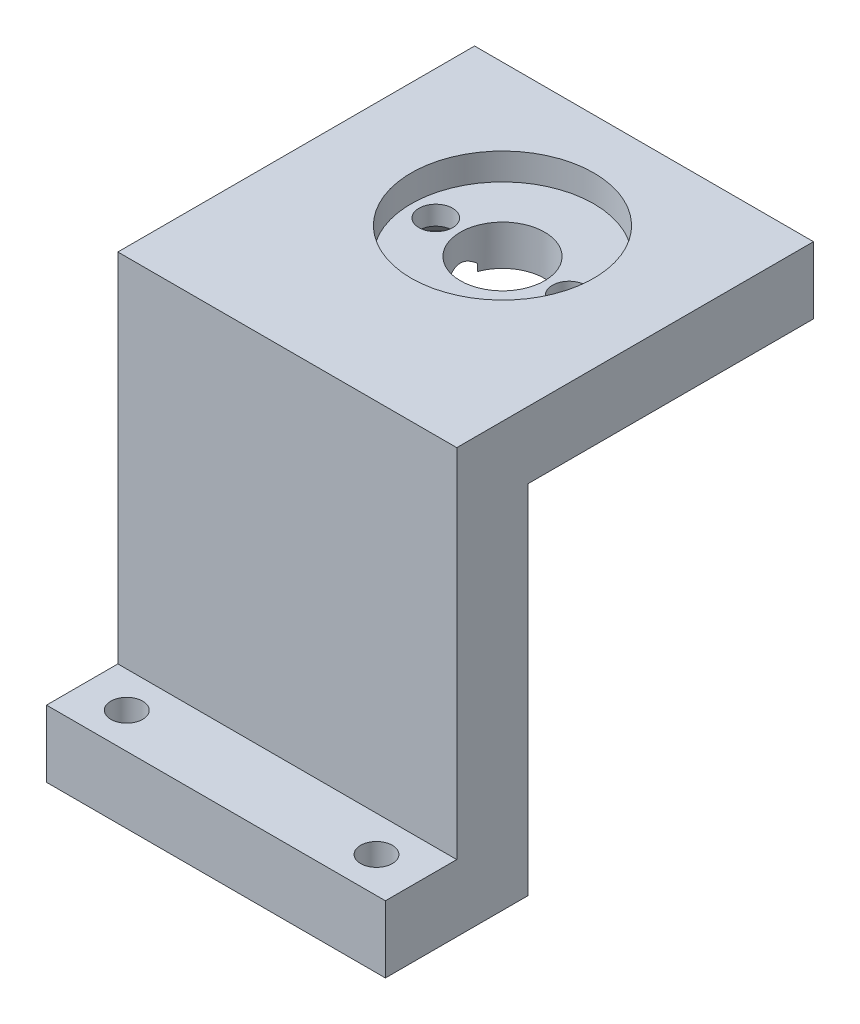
ISO-10303-21;
HEADER;
FILE_DESCRIPTION(('STEP AP214'),'2;1');
FILE_NAME('part.step','',(''),(''),'','','');
FILE_SCHEMA(('AUTOMOTIVE_DESIGN { 1 0 10303 214 1 1 1 1 }'));
ENDSEC;
DATA;
#1=APPLICATION_CONTEXT('core data for automotive mechanical design processes');
#2=APPLICATION_PROTOCOL_DEFINITION('international standard','automotive_design',2000,#1);
#3=PRODUCT_CONTEXT('',#1,'mechanical');
#4=PRODUCT('Part','Part','',(#3));
#5=PRODUCT_RELATED_PRODUCT_CATEGORY('part','',(#4));
#6=PRODUCT_DEFINITION_FORMATION('','',#4);
#7=PRODUCT_DEFINITION_CONTEXT('part definition',#1,'design');
#8=PRODUCT_DEFINITION('design','',#6,#7);
#9=PRODUCT_DEFINITION_SHAPE('','',#8);
#10=(LENGTH_UNIT() NAMED_UNIT(*) SI_UNIT(.MILLI.,.METRE.));
#11=(NAMED_UNIT(*) PLANE_ANGLE_UNIT() SI_UNIT($,.RADIAN.));
#12=(NAMED_UNIT(*) SI_UNIT($,.STERADIAN.) SOLID_ANGLE_UNIT());
#13=UNCERTAINTY_MEASURE_WITH_UNIT(LENGTH_MEASURE(1.E-05),#10,'distance_accuracy_value','');
#14=(GEOMETRIC_REPRESENTATION_CONTEXT(3) GLOBAL_UNCERTAINTY_ASSIGNED_CONTEXT((#13)) GLOBAL_UNIT_ASSIGNED_CONTEXT((#10,
#11,#12)) REPRESENTATION_CONTEXT('',''));
#15=CARTESIAN_POINT('',(0.,0.,0.));
#16=DIRECTION('',(0.,0.,1.));
#17=DIRECTION('',(1.,0.,0.));
#18=AXIS2_PLACEMENT_3D('',#15,#16,#17);
#19=CARTESIAN_POINT('',(0.,-0.001000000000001,-20.4020730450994));
#20=DIRECTION('',(0.,1.,0.));
#21=DIRECTION('',(0.,0.,1.));
#22=AXIS2_PLACEMENT_3D('',#19,#20,#21);
#23=CYLINDRICAL_SURFACE('',#22,3.);
#24=CARTESIAN_POINT('',(0.,25.4,-20.4020730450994));
#25=DIRECTION('',(0.,-1.,0.));
#26=DIRECTION('',(0.,0.,-1.));
#27=AXIS2_PLACEMENT_3D('',#24,#25,#26);
#28=CIRCLE('',#27,3.);
#29=CARTESIAN_POINT('',(2.8128947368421,25.4,-21.4449647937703));
#30=VERTEX_POINT('',#29);
#31=CARTESIAN_POINT('',(-2.8128947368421,25.4,-21.4449647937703));
#32=VERTEX_POINT('',#31);
#33=EDGE_CURVE('E224',#30,#32,#28,.F.);
#34=ORIENTED_EDGE('',*,*,#33,.F.);
#35=DIRECTION('',(0.,-1.,0.));
#36=VECTOR('',#35,1.);
#37=CARTESIAN_POINT('',(2.81289473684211,25.65019,-21.4449647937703));
#38=LINE('',#37,#36);
#39=CARTESIAN_POINT('',(2.81289473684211,25.90038,-21.4449647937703));
#40=VERTEX_POINT('',#39);
#41=EDGE_CURVE('E12',#30,#40,#38,.F.);
#42=ORIENTED_EDGE('',*,*,#41,.T.);
#43=CARTESIAN_POINT('',(2.55762322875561,25.4049988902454,-21.9700537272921));
#44=CARTESIAN_POINT('',(2.581957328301,25.4478742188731,-21.9303499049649));
#45=CARTESIAN_POINT('',(2.60552939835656,25.4904455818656,-21.889836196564));
#46=CARTESIAN_POINT('',(2.65110514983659,25.5747576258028,-21.8070237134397));
#47=CARTESIAN_POINT('',(2.67310754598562,25.6164976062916,-21.7647235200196));
#48=CARTESIAN_POINT('',(2.71581112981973,25.6995366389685,-21.6775196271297));
#49=CARTESIAN_POINT('',(2.73648469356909,25.7408169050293,-21.6325843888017));
#50=CARTESIAN_POINT('',(2.77602701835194,25.8218101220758,-21.5405730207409));
#51=CARTESIAN_POINT('',(2.79489631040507,25.861523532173,-21.4934975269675));
#52=CARTESIAN_POINT('',(2.82794104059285,25.9328631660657,-21.404392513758));
#53=CARTESIAN_POINT('',(2.84239123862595,25.9647907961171,-21.3627073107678));
#54=CARTESIAN_POINT('',(2.86980347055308,26.0266580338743,-21.2774212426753));
#55=CARTESIAN_POINT('',(2.88276588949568,26.0565981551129,-21.2338208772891));
#56=CARTESIAN_POINT('',(2.90700399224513,26.1137310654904,-21.1446710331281));
#57=CARTESIAN_POINT('',(2.91828685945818,26.1409353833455,-21.0991309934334));
#58=CARTESIAN_POINT('',(2.93902017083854,26.1918579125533,-21.0057665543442));
#59=CARTESIAN_POINT('',(2.94847193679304,26.2155786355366,-20.9579438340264));
#60=CARTESIAN_POINT('',(2.96698000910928,26.2627585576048,-20.8499591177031));
#61=CARTESIAN_POINT('',(2.97557123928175,26.2851981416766,-20.7892551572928));
#62=CARTESIAN_POINT('',(2.98911805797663,26.3209960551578,-20.6648768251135));
#63=CARTESIAN_POINT('',(2.9940816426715,26.3343743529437,-20.6012093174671));
#64=CARTESIAN_POINT('',(2.99989631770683,26.3500780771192,-20.4716899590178));
#65=CARTESIAN_POINT('',(3.00071071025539,26.3523048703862,-20.405823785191));
#66=CARTESIAN_POINT('',(2.99801764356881,26.3450052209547,-20.2747983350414));
#67=CARTESIAN_POINT('',(2.99450481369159,26.3354641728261,-20.2096400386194));
#68=CARTESIAN_POINT('',(2.98246021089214,26.3033203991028,-20.0690896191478));
#69=CARTESIAN_POINT('',(2.97305324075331,26.2784564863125,-19.9943101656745));
#70=CARTESIAN_POINT('',(2.94964336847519,26.2184184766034,-19.8498020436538));
#71=CARTESIAN_POINT('',(2.93562877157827,26.1832181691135,-19.7800867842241));
#72=CARTESIAN_POINT('',(2.90489537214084,26.1085717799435,-19.6499055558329));
#73=CARTESIAN_POINT('',(2.88841167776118,26.0695506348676,-19.5891329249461));
#74=CARTESIAN_POINT('',(2.85263976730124,25.9875367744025,-19.4713594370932));
#75=CARTESIAN_POINT('',(2.83335465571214,25.9445484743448,-19.4143545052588));
#76=CARTESIAN_POINT('',(2.78255090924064,25.8348742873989,-19.2773546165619));
#77=CARTESIAN_POINT('',(2.74955383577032,25.7665784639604,-19.1992049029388));
#78=CARTESIAN_POINT('',(2.67859929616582,25.6263659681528,-19.0485465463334));
#79=CARTESIAN_POINT('',(2.64063705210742,25.554445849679,-18.9760434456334));
#80=CARTESIAN_POINT('',(2.56000137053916,25.4081971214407,-18.8358860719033));
#81=CARTESIAN_POINT('',(2.51731710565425,25.3338632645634,-18.7682435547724));
#82=CARTESIAN_POINT('',(2.42753854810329,25.1837864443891,-18.6376084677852));
#83=CARTESIAN_POINT('',(2.3804440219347,25.1080434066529,-18.5746161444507));
#84=CARTESIAN_POINT('',(2.30105899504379,24.9851552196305,-18.4766052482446));
#85=CARTESIAN_POINT('',(2.27008117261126,24.9382707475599,-18.440184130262));
#86=CARTESIAN_POINT('',(2.20669869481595,24.8444535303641,-18.3691600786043));
#87=CARTESIAN_POINT('',(2.1742999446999,24.7975216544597,-18.3345507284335));
#88=CARTESIAN_POINT('',(2.14115110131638,24.7505196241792,-18.3007706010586));
#89=B_SPLINE_CURVE_WITH_KNOTS('',3,(#43,#44,#45,#46,#47,#48,#49,#50,#51,#52,#53,#54,#55,#56,#57,
#58,#59,#60,#61,#62,#63,#64,#65,#66,#67,#68,#69,#70,#71,#72,#73,#74,#75,#76,#77,#78,#79,#80,#81,
#82,#83,#84,#85,#86,#87,#88),.UNSPECIFIED.,.F.,.F.,(4,2,2,2,2,2,2,2,2,2,2,2,2,2,2,2,2,2,2,2,2,2,
4),(0.,0.189901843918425,0.379957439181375,0.573164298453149,0.766314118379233,
0.929617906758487,1.09287933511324,1.25542109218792,1.41784507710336,1.61306033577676,
1.8078439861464,2.00434745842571,2.20109506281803,2.43784334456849,2.67519722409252,
2.8971166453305,3.11879198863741,3.44507470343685,3.77167373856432,4.09903781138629,
4.42641922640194,4.62727760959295,4.82736838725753),.UNSPECIFIED.);
#90=CARTESIAN_POINT('',(2.81289473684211,25.90038,-19.3591812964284));
#91=VERTEX_POINT('',#90);
#92=EDGE_CURVE('E209',#40,#91,#89,.T.);
#93=ORIENTED_EDGE('',*,*,#92,.T.);
#94=DIRECTION('',(0.,-1.,0.));
#95=VECTOR('',#94,1.);
#96=CARTESIAN_POINT('',(2.81289473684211,25.65019,-19.3591812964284));
#97=LINE('',#96,#95);
#98=CARTESIAN_POINT('',(2.8128947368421,25.4,-19.3591812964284));
#99=VERTEX_POINT('',#98);
#100=EDGE_CURVE('E130',#91,#99,#97,.T.);
#101=ORIENTED_EDGE('',*,*,#100,.T.);
#102=CARTESIAN_POINT('',(-2.8128947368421,25.4,-19.3591812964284));
#103=VERTEX_POINT('',#102);
#104=EDGE_CURVE('E230',#103,#99,#28,.F.);
#105=ORIENTED_EDGE('',*,*,#104,.F.);
#106=DIRECTION('',(0.,-1.,0.));
#107=VECTOR('',#106,1.);
#108=CARTESIAN_POINT('',(-2.81289473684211,25.65019,-19.3591812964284));
#109=LINE('',#108,#107);
#110=CARTESIAN_POINT('',(-2.81289473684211,25.90038,-19.3591812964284));
#111=VERTEX_POINT('',#110);
#112=EDGE_CURVE('E213',#103,#111,#109,.F.);
#113=ORIENTED_EDGE('',*,*,#112,.T.);
#114=CARTESIAN_POINT('',(-2.55762322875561,25.4049988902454,-18.8340923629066));
#115=CARTESIAN_POINT('',(-2.58195732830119,25.4478742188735,-18.8737961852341));
#116=CARTESIAN_POINT('',(-2.60552939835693,25.4904455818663,-18.9143098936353));
#117=CARTESIAN_POINT('',(-2.65110514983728,25.5747576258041,-18.9971223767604));
#118=CARTESIAN_POINT('',(-2.67310754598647,25.6164976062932,-19.0394225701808));
#119=CARTESIAN_POINT('',(-2.71581112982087,25.6995366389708,-19.1266264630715));
#120=CARTESIAN_POINT('',(-2.73648469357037,25.7408169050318,-19.1715617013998));
#121=CARTESIAN_POINT('',(-2.77602701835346,25.8218101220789,-19.2635730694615));
#122=CARTESIAN_POINT('',(-2.79489631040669,25.8615235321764,-19.3106485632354));
#123=CARTESIAN_POINT('',(-2.82794104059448,25.9328631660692,-19.3997535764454));
#124=CARTESIAN_POINT('',(-2.84239123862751,25.9647907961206,-19.4414387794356));
#125=CARTESIAN_POINT('',(-2.86980347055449,26.0266580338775,-19.526724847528));
#126=CARTESIAN_POINT('',(-2.88276588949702,26.056598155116,-19.5703252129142));
#127=CARTESIAN_POINT('',(-2.90700399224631,26.1137310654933,-19.6594750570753));
#128=CARTESIAN_POINT('',(-2.91828685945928,26.1409353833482,-19.70501509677));
#129=CARTESIAN_POINT('',(-2.93902017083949,26.1918579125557,-19.7983795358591));
#130=CARTESIAN_POINT('',(-2.94847193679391,26.2155786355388,-19.846202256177));
#131=CARTESIAN_POINT('',(-2.96698000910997,26.2627585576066,-19.9541869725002));
#132=CARTESIAN_POINT('',(-2.97557123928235,26.2851981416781,-20.0148909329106));
#133=CARTESIAN_POINT('',(-2.98911805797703,26.3209960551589,-20.1392692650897));
#134=CARTESIAN_POINT('',(-2.99408164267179,26.3343743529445,-20.2029367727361));
#135=CARTESIAN_POINT('',(-2.99989631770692,26.3500780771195,-20.3324561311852));
#136=CARTESIAN_POINT('',(-3.00071071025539,26.3523048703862,-20.3983223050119));
#137=CARTESIAN_POINT('',(-2.99801764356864,26.3450052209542,-20.5293477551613));
#138=CARTESIAN_POINT('',(-2.99450481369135,26.3354641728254,-20.594506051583));
#139=CARTESIAN_POINT('',(-2.98246021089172,26.3033203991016,-20.7350564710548));
#140=CARTESIAN_POINT('',(-2.97305324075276,26.278456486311,-20.8098359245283));
#141=CARTESIAN_POINT('',(-2.94964336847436,26.2184184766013,-20.9543440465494));
#142=CARTESIAN_POINT('',(-2.93562877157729,26.1832181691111,-21.0240593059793));
#143=CARTESIAN_POINT('',(-2.90489537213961,26.1085717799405,-21.1542405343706));
#144=CARTESIAN_POINT('',(-2.88841167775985,26.0695506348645,-21.2150131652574));
#145=CARTESIAN_POINT('',(-2.85263976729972,25.9875367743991,-21.3327866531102));
#146=CARTESIAN_POINT('',(-2.83335465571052,25.9445484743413,-21.3897915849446));
#147=CARTESIAN_POINT('',(-2.78255090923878,25.834874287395,-21.5267914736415));
#148=CARTESIAN_POINT('',(-2.7495538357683,25.7665784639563,-21.6049411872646));
#149=CARTESIAN_POINT('',(-2.67859929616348,25.6263659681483,-21.7555995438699));
#150=CARTESIAN_POINT('',(-2.64063705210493,25.5544458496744,-21.82810264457));
#151=CARTESIAN_POINT('',(-2.56000137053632,25.4081971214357,-21.9682600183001));
#152=CARTESIAN_POINT('',(-2.51731710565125,25.3338632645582,-22.0359025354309));
#153=CARTESIAN_POINT('',(-2.42753854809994,25.1837864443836,-22.1665376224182));
#154=CARTESIAN_POINT('',(-2.38044402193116,25.1080434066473,-22.2295299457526));
#155=CARTESIAN_POINT('',(-2.30105899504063,24.9851552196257,-22.3275408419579));
#156=CARTESIAN_POINT('',(-2.27008117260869,24.9382707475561,-22.3639619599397));
#157=CARTESIAN_POINT('',(-2.20669869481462,24.8444535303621,-22.4349860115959));
#158=CARTESIAN_POINT('',(-2.17429994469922,24.7975216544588,-22.4695953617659));
#159=CARTESIAN_POINT('',(-2.14115110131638,24.7505196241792,-22.5033754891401));
#160=B_SPLINE_CURVE_WITH_KNOTS('',3,(#114,#115,#116,#117,#118,#119,#120,#121,#122,#123,#124,
#125,#126,#127,#128,#129,#130,#131,#132,#133,#134,#135,#136,#137,#138,#139,#140,#141,#142,#143,
#144,#145,#146,#147,#148,#149,#150,#151,#152,#153,#154,#155,#156,#157,#158,#159),.UNSPECIFIED.,
.F.,.F.,(4,2,2,2,2,2,2,2,2,2,2,2,2,2,2,2,2,2,2,2,2,2,4),(0.,0.1899018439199,0.379957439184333,
0.573164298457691,0.766314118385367,0.92961790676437,1.09287933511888,1.25542109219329,
1.41784507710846,1.61306033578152,1.80784398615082,2.00434745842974,2.20109506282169,
2.43784334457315,2.67519722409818,2.89711664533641,3.11879198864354,3.44507470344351,
3.77167373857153,4.09903781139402,4.42641922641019,4.62727760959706,4.82736838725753),.UNSPECIFIED.);
#161=CARTESIAN_POINT('',(-2.81289473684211,25.90038,-21.4449647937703));
#162=VERTEX_POINT('',#161);
#163=EDGE_CURVE('E301',#111,#162,#160,.T.);
#164=ORIENTED_EDGE('',*,*,#163,.T.);
#165=DIRECTION('',(0.,-1.,0.));
#166=VECTOR('',#165,1.);
#167=CARTESIAN_POINT('',(-2.81289473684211,25.65019,-21.4449647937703));
#168=LINE('',#167,#166);
#169=EDGE_CURVE('E226',#162,#32,#168,.T.);
#170=ORIENTED_EDGE('',*,*,#169,.T.);
#171=EDGE_LOOP('',(#34,#42,#93,#101,#105,#113,#164,#170));
#172=FACE_BOUND('',#171,.T.);
#173=CARTESIAN_POINT('',(0.,28.2575,-20.4020730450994));
#174=DIRECTION('',(0.,1.,0.));
#175=DIRECTION('',(0.,0.,1.));
#176=AXIS2_PLACEMENT_3D('',#173,#174,#175);
#177=CIRCLE('',#176,3.);
#178=CARTESIAN_POINT('',(0.,28.2575,-17.4020730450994));
#179=VERTEX_POINT('',#178);
#180=EDGE_CURVE('E347',#179,#179,#177,.F.);
#181=ORIENTED_EDGE('',*,*,#180,.F.);
#182=EDGE_LOOP('',(#181));
#183=FACE_BOUND('',#182,.T.);
#184=ADVANCED_FACE('F121',(#172,#183),#23,.F.);
#185=CARTESIAN_POINT('',(-4.75,25.4,-20.4020730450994));
#186=DIRECTION('',(0.,-1.,0.));
#187=DIRECTION('',(0.,0.,-1.));
#188=AXIS2_PLACEMENT_3D('',#185,#186,#187);
#189=CYLINDRICAL_SURFACE('',#188,1.20000000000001);
#190=CARTESIAN_POINT('',(-4.75,26.90038,-20.4020730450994));
#191=DIRECTION('',(0.,-1.,0.));
#192=DIRECTION('',(0.,0.,-1.));
#193=AXIS2_PLACEMENT_3D('',#190,#191,#192);
#194=CIRCLE('',#193,1.20000000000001);
#195=CARTESIAN_POINT('',(-4.75,26.90038,-21.6020730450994));
#196=VERTEX_POINT('',#195);
#197=EDGE_CURVE('E231',#196,#196,#194,.T.);
#198=ORIENTED_EDGE('',*,*,#197,.T.);
#199=EDGE_LOOP('',(#198));
#200=FACE_BOUND('',#199,.T.);
#201=CARTESIAN_POINT('',(-4.75,28.2575,-20.4020730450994));
#202=DIRECTION('',(0.,1.,0.));
#203=DIRECTION('',(0.,0.,1.));
#204=AXIS2_PLACEMENT_3D('',#201,#202,#203);
#205=CIRCLE('',#204,1.20000000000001);
#206=CARTESIAN_POINT('',(-4.75,28.2575,-19.2020730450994));
#207=VERTEX_POINT('',#206);
#208=EDGE_CURVE('E345',#207,#207,#205,.F.);
#209=ORIENTED_EDGE('',*,*,#208,.F.);
#210=EDGE_LOOP('',(#209));
#211=FACE_BOUND('',#210,.T.);
#212=ADVANCED_FACE('F332',(#200,#211),#189,.F.);
#213=CARTESIAN_POINT('',(4.75,25.4,-20.4020730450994));
#214=DIRECTION('',(0.,-1.,0.));
#215=DIRECTION('',(0.,0.,-1.));
#216=AXIS2_PLACEMENT_3D('',#213,#214,#215);
#217=CYLINDRICAL_SURFACE('',#216,1.20000000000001);
#218=CARTESIAN_POINT('',(4.75,26.90038,-20.4020730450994));
#219=DIRECTION('',(0.,-1.,0.));
#220=DIRECTION('',(0.,0.,-1.));
#221=AXIS2_PLACEMENT_3D('',#218,#219,#220);
#222=CIRCLE('',#221,1.20000000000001);
#223=CARTESIAN_POINT('',(4.75,26.90038,-21.6020730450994));
#224=VERTEX_POINT('',#223);
#225=EDGE_CURVE('E218',#224,#224,#222,.T.);
#226=ORIENTED_EDGE('',*,*,#225,.T.);
#227=EDGE_LOOP('',(#226));
#228=FACE_BOUND('',#227,.T.);
#229=CARTESIAN_POINT('',(4.75,28.2575,-20.4020730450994));
#230=DIRECTION('',(0.,1.,0.));
#231=DIRECTION('',(0.,0.,1.));
#232=AXIS2_PLACEMENT_3D('',#229,#230,#231);
#233=CIRCLE('',#232,1.20000000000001);
#234=CARTESIAN_POINT('',(4.75,28.2575,-19.2020730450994));
#235=VERTEX_POINT('',#234);
#236=EDGE_CURVE('E125',#235,#235,#233,.F.);
#237=ORIENTED_EDGE('',*,*,#236,.F.);
#238=EDGE_LOOP('',(#237));
#239=FACE_BOUND('',#238,.T.);
#240=ADVANCED_FACE('F334',(#228,#239),#217,.F.);
#241=CARTESIAN_POINT('',(-12.065,25.4,-10.16));
#242=DIRECTION('',(0.,0.,-1.));
#243=DIRECTION('',(0.,1.,0.));
#244=AXIS2_PLACEMENT_3D('',#241,#242,#243);
#245=PLANE('',#244);
#246=DIRECTION('',(1.,0.,0.));
#247=VECTOR('',#246,1.);
#248=CARTESIAN_POINT('',(-12.065,25.4,-10.16));
#249=LINE('',#248,#247);
#250=CARTESIAN_POINT('',(-12.065,25.4,-10.16));
#251=VERTEX_POINT('',#250);
#252=CARTESIAN_POINT('',(12.065,25.4,-10.16));
#253=VERTEX_POINT('',#252);
#254=EDGE_CURVE('E298',#251,#253,#249,.T.);
#255=ORIENTED_EDGE('',*,*,#254,.T.);
#256=DIRECTION('',(0.,1.,0.));
#257=VECTOR('',#256,1.);
#258=CARTESIAN_POINT('',(12.065,25.4,-10.16));
#259=LINE('',#258,#257);
#260=CARTESIAN_POINT('',(12.065,0.,-10.16));
#261=VERTEX_POINT('',#260);
#262=EDGE_CURVE('E250',#261,#253,#259,.T.);
#263=ORIENTED_EDGE('',*,*,#262,.F.);
#264=DIRECTION('',(1.,0.,0.));
#265=VECTOR('',#264,1.);
#266=CARTESIAN_POINT('',(-12.065,0.,-10.16));
#267=LINE('',#266,#265);
#268=CARTESIAN_POINT('',(-12.065,0.,-10.16));
#269=VERTEX_POINT('',#268);
#270=EDGE_CURVE('E299',#269,#261,#267,.T.);
#271=ORIENTED_EDGE('',*,*,#270,.F.);
#272=DIRECTION('',(0.,1.,0.));
#273=VECTOR('',#272,1.);
#274=CARTESIAN_POINT('',(-12.065,25.4,-10.16));
#275=LINE('',#274,#273);
#276=EDGE_CURVE('E274',#269,#251,#275,.T.);
#277=ORIENTED_EDGE('',*,*,#276,.T.);
#278=EDGE_LOOP('',(#255,#263,#271,#277));
#279=FACE_BOUND('',#278,.T.);
#280=ADVANCED_FACE('F123',(#279),#245,.T.);
#281=CARTESIAN_POINT('',(-12.065,0.,-10.16));
#282=DIRECTION('',(0.,-1.,0.));
#283=DIRECTION('',(0.,0.,-1.));
#284=AXIS2_PLACEMENT_3D('',#281,#282,#283);
#285=PLANE('',#284);
#286=CARTESIAN_POINT('',(5.715,0.,-8.128));
#287=DIRECTION('',(0.,-1.,0.));
#288=DIRECTION('',(0.,0.,-1.));
#289=AXIS2_PLACEMENT_3D('',#286,#287,#288);
#290=CIRCLE('',#289,1.19062499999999);
#291=CARTESIAN_POINT('',(5.715,0.,-9.31862499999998));
#292=VERTEX_POINT('',#291);
#293=EDGE_CURVE('E350',#292,#292,#290,.T.);
#294=ORIENTED_EDGE('',*,*,#293,.F.);
#295=EDGE_LOOP('',(#294));
#296=FACE_BOUND('',#295,.T.);
#297=CARTESIAN_POINT('',(-5.715,0.,-8.128));
#298=DIRECTION('',(0.,-1.,0.));
#299=DIRECTION('',(0.,0.,-1.));
#300=AXIS2_PLACEMENT_3D('',#297,#298,#299);
#301=CIRCLE('',#300,1.19062499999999);
#302=CARTESIAN_POINT('',(-5.715,0.,-9.31862499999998));
#303=VERTEX_POINT('',#302);
#304=EDGE_CURVE('E363',#303,#303,#301,.T.);
#305=ORIENTED_EDGE('',*,*,#304,.F.);
#306=EDGE_LOOP('',(#305));
#307=FACE_BOUND('',#306,.T.);
#308=CARTESIAN_POINT('',(-8.89,0.,-2.54));
#309=DIRECTION('',(0.,-1.,0.));
#310=DIRECTION('',(0.,0.,-1.));
#311=AXIS2_PLACEMENT_3D('',#308,#309,#310);
#312=CIRCLE('',#311,1.13029999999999);
#313=CARTESIAN_POINT('',(-8.89,0.,-3.67029999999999));
#314=VERTEX_POINT('',#313);
#315=EDGE_CURVE('E241',#314,#314,#312,.T.);
#316=ORIENTED_EDGE('',*,*,#315,.F.);
#317=EDGE_LOOP('',(#316));
#318=FACE_BOUND('',#317,.T.);
#319=CARTESIAN_POINT('',(8.89,0.,-2.54));
#320=DIRECTION('',(0.,-1.,0.));
#321=DIRECTION('',(0.,0.,-1.));
#322=AXIS2_PLACEMENT_3D('',#319,#320,#321);
#323=CIRCLE('',#322,1.13029999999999);
#324=CARTESIAN_POINT('',(8.89,0.,-3.67029999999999));
#325=VERTEX_POINT('',#324);
#326=EDGE_CURVE('E247',#325,#325,#323,.T.);
#327=ORIENTED_EDGE('',*,*,#326,.F.);
#328=EDGE_LOOP('',(#327));
#329=FACE_BOUND('',#328,.T.);
#330=ORIENTED_EDGE('',*,*,#270,.T.);
#331=DIRECTION('',(0.,0.,-1.));
#332=VECTOR('',#331,1.);
#333=CARTESIAN_POINT('',(12.065,0.,-10.16));
#334=LINE('',#333,#332);
#335=CARTESIAN_POINT('',(12.065,0.,0.));
#336=VERTEX_POINT('',#335);
#337=EDGE_CURVE('E271',#336,#261,#334,.T.);
#338=ORIENTED_EDGE('',*,*,#337,.F.);
#339=DIRECTION('',(1.,0.,0.));
#340=VECTOR('',#339,1.);
#341=CARTESIAN_POINT('',(-12.065,0.,0.));
#342=LINE('',#341,#340);
#343=CARTESIAN_POINT('',(-12.065,0.,0.));
#344=VERTEX_POINT('',#343);
#345=EDGE_CURVE('E302',#344,#336,#342,.T.);
#346=ORIENTED_EDGE('',*,*,#345,.F.);
#347=DIRECTION('',(0.,0.,-1.));
#348=VECTOR('',#347,1.);
#349=CARTESIAN_POINT('',(-12.065,0.,-10.16));
#350=LINE('',#349,#348);
#351=EDGE_CURVE('E295',#344,#269,#350,.T.);
#352=ORIENTED_EDGE('',*,*,#351,.T.);
#353=EDGE_LOOP('',(#330,#338,#346,#352));
#354=FACE_BOUND('',#353,.T.);
#355=ADVANCED_FACE('F454',(#296,#307,#318,#329,#354),#285,.T.);
#356=CARTESIAN_POINT('',(-12.065,0.,0.));
#357=DIRECTION('',(0.,0.,1.));
#358=DIRECTION('',(1.,0.,0.));
#359=AXIS2_PLACEMENT_3D('',#356,#357,#358);
#360=PLANE('',#359);
#361=ORIENTED_EDGE('',*,*,#345,.T.);
#362=DIRECTION('',(0.,-1.,0.));
#363=VECTOR('',#362,1.);
#364=CARTESIAN_POINT('',(12.065,0.,0.));
#365=LINE('',#364,#363);
#366=CARTESIAN_POINT('',(12.065,4.7625,0.));
#367=VERTEX_POINT('',#366);
#368=EDGE_CURVE('E268',#367,#336,#365,.T.);
#369=ORIENTED_EDGE('',*,*,#368,.F.);
#370=DIRECTION('',(1.,0.,0.));
#371=VECTOR('',#370,1.);
#372=CARTESIAN_POINT('',(-12.065,4.7625,0.));
#373=LINE('',#372,#371);
#374=CARTESIAN_POINT('',(-12.065,4.7625,0.));
#375=VERTEX_POINT('',#374);
#376=EDGE_CURVE('E304',#375,#367,#373,.T.);
#377=ORIENTED_EDGE('',*,*,#376,.F.);
#378=DIRECTION('',(0.,-1.,0.));
#379=VECTOR('',#378,1.);
#380=CARTESIAN_POINT('',(-12.065,0.,0.));
#381=LINE('',#380,#379);
#382=EDGE_CURVE('E292',#375,#344,#381,.T.);
#383=ORIENTED_EDGE('',*,*,#382,.T.);
#384=EDGE_LOOP('',(#361,#369,#377,#383));
#385=FACE_BOUND('',#384,.T.);
#386=ADVANCED_FACE('F449',(#385),#360,.T.);
#387=CARTESIAN_POINT('',(-12.065,4.7625,0.));
#388=DIRECTION('',(0.,1.,0.));
#389=DIRECTION('',(0.,0.,1.));
#390=AXIS2_PLACEMENT_3D('',#387,#388,#389);
#391=PLANE('',#390);
#392=CARTESIAN_POINT('',(-8.89,4.7625,-2.54));
#393=DIRECTION('',(0.,1.,0.));
#394=DIRECTION('',(0.,0.,1.));
#395=AXIS2_PLACEMENT_3D('',#392,#393,#394);
#396=CIRCLE('',#395,1.13029999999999);
#397=CARTESIAN_POINT('',(-8.89,4.7625,-1.40970000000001));
#398=VERTEX_POINT('',#397);
#399=EDGE_CURVE('E234',#398,#398,#396,.T.);
#400=ORIENTED_EDGE('',*,*,#399,.F.);
#401=EDGE_LOOP('',(#400));
#402=FACE_BOUND('',#401,.T.);
#403=CARTESIAN_POINT('',(8.89,4.7625,-2.54));
#404=DIRECTION('',(0.,1.,0.));
#405=DIRECTION('',(0.,0.,1.));
#406=AXIS2_PLACEMENT_3D('',#403,#404,#405);
#407=CIRCLE('',#406,1.13029999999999);
#408=CARTESIAN_POINT('',(8.89,4.7625,-1.40970000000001));
#409=VERTEX_POINT('',#408);
#410=EDGE_CURVE('E244',#409,#409,#407,.T.);
#411=ORIENTED_EDGE('',*,*,#410,.F.);
#412=EDGE_LOOP('',(#411));
#413=FACE_BOUND('',#412,.T.);
#414=ORIENTED_EDGE('',*,*,#376,.T.);
#415=DIRECTION('',(0.,0.,1.));
#416=VECTOR('',#415,1.);
#417=CARTESIAN_POINT('',(12.065,4.7625,0.));
#418=LINE('',#417,#416);
#419=CARTESIAN_POINT('',(12.065,4.7625,-5.08));
#420=VERTEX_POINT('',#419);
#421=EDGE_CURVE('E265',#420,#367,#418,.T.);
#422=ORIENTED_EDGE('',*,*,#421,.F.);
#423=DIRECTION('',(1.,0.,0.));
#424=VECTOR('',#423,1.);
#425=CARTESIAN_POINT('',(-12.065,4.7625,-5.08));
#426=LINE('',#425,#424);
#427=CARTESIAN_POINT('',(-12.065,4.7625,-5.08));
#428=VERTEX_POINT('',#427);
#429=EDGE_CURVE('E306',#428,#420,#426,.T.);
#430=ORIENTED_EDGE('',*,*,#429,.F.);
#431=DIRECTION('',(0.,0.,1.));
#432=VECTOR('',#431,1.);
#433=CARTESIAN_POINT('',(-12.065,4.7625,0.));
#434=LINE('',#433,#432);
#435=EDGE_CURVE('E289',#428,#375,#434,.T.);
#436=ORIENTED_EDGE('',*,*,#435,.T.);
#437=EDGE_LOOP('',(#414,#422,#430,#436));
#438=FACE_BOUND('',#437,.T.);
#439=ADVANCED_FACE('F442',(#402,#413,#438),#391,.T.);
#440=CARTESIAN_POINT('',(-12.065,4.7625,-5.08));
#441=DIRECTION('',(0.,0.,1.));
#442=DIRECTION('',(1.,0.,0.));
#443=AXIS2_PLACEMENT_3D('',#440,#441,#442);
#444=PLANE('',#443);
#445=ORIENTED_EDGE('',*,*,#429,.T.);
#446=DIRECTION('',(0.,-1.,0.));
#447=VECTOR('',#446,1.);
#448=CARTESIAN_POINT('',(12.065,4.7625,-5.08));
#449=LINE('',#448,#447);
#450=CARTESIAN_POINT('',(12.065,30.1625,-5.08));
#451=VERTEX_POINT('',#450);
#452=EDGE_CURVE('E262',#451,#420,#449,.T.);
#453=ORIENTED_EDGE('',*,*,#452,.F.);
#454=DIRECTION('',(1.,0.,0.));
#455=VECTOR('',#454,1.);
#456=CARTESIAN_POINT('',(-12.065,30.1625,-5.08));
#457=LINE('',#456,#455);
#458=CARTESIAN_POINT('',(-12.065,30.1625,-5.08));
#459=VERTEX_POINT('',#458);
#460=EDGE_CURVE('E308',#459,#451,#457,.T.);
#461=ORIENTED_EDGE('',*,*,#460,.F.);
#462=DIRECTION('',(0.,-1.,0.));
#463=VECTOR('',#462,1.);
#464=CARTESIAN_POINT('',(-12.065,4.7625,-5.08));
#465=LINE('',#464,#463);
#466=EDGE_CURVE('E286',#459,#428,#465,.T.);
#467=ORIENTED_EDGE('',*,*,#466,.T.);
#468=EDGE_LOOP('',(#445,#453,#461,#467));
#469=FACE_BOUND('',#468,.T.);
#470=ADVANCED_FACE('F429',(#469),#444,.T.);
#471=CARTESIAN_POINT('',(-12.065,30.1625,-5.08));
#472=DIRECTION('',(0.,1.,0.));
#473=DIRECTION('',(0.,0.,1.));
#474=AXIS2_PLACEMENT_3D('',#471,#472,#473);
#475=PLANE('',#474);
#476=CARTESIAN_POINT('',(0.,30.1625,-20.4020730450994));
#477=DIRECTION('',(0.,1.,0.));
#478=DIRECTION('',(0.,0.,1.));
#479=AXIS2_PLACEMENT_3D('',#476,#477,#478);
#480=CIRCLE('',#479,6.5);
#481=CARTESIAN_POINT('',(0.,30.1625,-13.9020730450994));
#482=VERTEX_POINT('',#481);
#483=EDGE_CURVE('E355',#482,#482,#480,.T.);
#484=ORIENTED_EDGE('',*,*,#483,.F.);
#485=EDGE_LOOP('',(#484));
#486=FACE_BOUND('',#485,.T.);
#487=ORIENTED_EDGE('',*,*,#460,.T.);
#488=DIRECTION('',(0.,0.,1.));
#489=VECTOR('',#488,1.);
#490=CARTESIAN_POINT('',(12.065,30.1625,-5.08));
#491=LINE('',#490,#489);
#492=CARTESIAN_POINT('',(12.065,30.1625,-30.48));
#493=VERTEX_POINT('',#492);
#494=EDGE_CURVE('E259',#493,#451,#491,.T.);
#495=ORIENTED_EDGE('',*,*,#494,.F.);
#496=DIRECTION('',(1.,0.,0.));
#497=VECTOR('',#496,1.);
#498=CARTESIAN_POINT('',(-12.065,30.1625,-30.48));
#499=LINE('',#498,#497);
#500=CARTESIAN_POINT('',(-12.065,30.1625,-30.48));
#501=VERTEX_POINT('',#500);
#502=EDGE_CURVE('E310',#501,#493,#499,.T.);
#503=ORIENTED_EDGE('',*,*,#502,.F.);
#504=DIRECTION('',(0.,0.,1.));
#505=VECTOR('',#504,1.);
#506=CARTESIAN_POINT('',(-12.065,30.1625,-5.08));
#507=LINE('',#506,#505);
#508=EDGE_CURVE('E283',#501,#459,#507,.T.);
#509=ORIENTED_EDGE('',*,*,#508,.T.);
#510=EDGE_LOOP('',(#487,#495,#503,#509));
#511=FACE_BOUND('',#510,.T.);
#512=ADVANCED_FACE('F425',(#486,#511),#475,.T.);
#513=CARTESIAN_POINT('',(-12.065,30.1625,-30.48));
#514=DIRECTION('',(0.,0.,-1.));
#515=DIRECTION('',(-1.,0.,0.));
#516=AXIS2_PLACEMENT_3D('',#513,#514,#515);
#517=PLANE('',#516);
#518=ORIENTED_EDGE('',*,*,#502,.T.);
#519=DIRECTION('',(0.,1.,0.));
#520=VECTOR('',#519,1.);
#521=CARTESIAN_POINT('',(12.065,30.1625,-30.48));
#522=LINE('',#521,#520);
#523=CARTESIAN_POINT('',(12.065,25.4,-30.48));
#524=VERTEX_POINT('',#523);
#525=EDGE_CURVE('E256',#524,#493,#522,.T.);
#526=ORIENTED_EDGE('',*,*,#525,.F.);
#527=DIRECTION('',(1.,0.,0.));
#528=VECTOR('',#527,1.);
#529=CARTESIAN_POINT('',(-12.065,25.4,-30.48));
#530=LINE('',#529,#528);
#531=CARTESIAN_POINT('',(-12.065,25.4,-30.48));
#532=VERTEX_POINT('',#531);
#533=EDGE_CURVE('E312',#532,#524,#530,.T.);
#534=ORIENTED_EDGE('',*,*,#533,.F.);
#535=DIRECTION('',(0.,1.,0.));
#536=VECTOR('',#535,1.);
#537=CARTESIAN_POINT('',(-12.065,30.1625,-30.48));
#538=LINE('',#537,#536);
#539=EDGE_CURVE('E280',#532,#501,#538,.T.);
#540=ORIENTED_EDGE('',*,*,#539,.T.);
#541=EDGE_LOOP('',(#518,#526,#534,#540));
#542=FACE_BOUND('',#541,.T.);
#543=ADVANCED_FACE('F428',(#542),#517,.T.);
#544=CARTESIAN_POINT('',(-12.065,25.4,-30.48));
#545=DIRECTION('',(0.,-1.,0.));
#546=DIRECTION('',(0.,0.,-1.));
#547=AXIS2_PLACEMENT_3D('',#544,#545,#546);
#548=PLANE('',#547);
#549=CARTESIAN_POINT('',(4.75,25.4,-20.4020730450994));
#550=DIRECTION('',(0.,-1.,0.));
#551=DIRECTION('',(0.,0.,-1.));
#552=AXIS2_PLACEMENT_3D('',#549,#550,#551);
#553=CIRCLE('',#552,2.2);
#554=EDGE_CURVE('E219',#30,#99,#553,.T.);
#555=ORIENTED_EDGE('',*,*,#554,.F.);
#556=ORIENTED_EDGE('',*,*,#33,.T.);
#557=CARTESIAN_POINT('',(-4.75,25.4,-20.4020730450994));
#558=DIRECTION('',(0.,-1.,0.));
#559=DIRECTION('',(0.,0.,-1.));
#560=AXIS2_PLACEMENT_3D('',#557,#558,#559);
#561=CIRCLE('',#560,2.2);
#562=EDGE_CURVE('E372',#103,#32,#561,.T.);
#563=ORIENTED_EDGE('',*,*,#562,.F.);
#564=ORIENTED_EDGE('',*,*,#104,.T.);
#565=EDGE_LOOP('',(#555,#556,#563,#564));
#566=FACE_BOUND('',#565,.T.);
#567=ORIENTED_EDGE('',*,*,#533,.T.);
#568=DIRECTION('',(0.,0.,-1.));
#569=VECTOR('',#568,1.);
#570=CARTESIAN_POINT('',(12.065,25.4,-30.48));
#571=LINE('',#570,#569);
#572=EDGE_CURVE('E253',#253,#524,#571,.T.);
#573=ORIENTED_EDGE('',*,*,#572,.F.);
#574=ORIENTED_EDGE('',*,*,#254,.F.);
#575=DIRECTION('',(0.,0.,-1.));
#576=VECTOR('',#575,1.);
#577=CARTESIAN_POINT('',(-12.065,25.4,-30.48));
#578=LINE('',#577,#576);
#579=EDGE_CURVE('E277',#251,#532,#578,.T.);
#580=ORIENTED_EDGE('',*,*,#579,.T.);
#581=EDGE_LOOP('',(#567,#573,#574,#580));
#582=FACE_BOUND('',#581,.T.);
#583=ADVANCED_FACE('F376',(#566,#582),#548,.T.);
#584=CARTESIAN_POINT('',(-12.065,0.,-10.16));
#585=DIRECTION('',(-1.,0.,0.));
#586=DIRECTION('',(0.,0.,1.));
#587=AXIS2_PLACEMENT_3D('',#584,#585,#586);
#588=PLANE('',#587);
#589=ORIENTED_EDGE('',*,*,#276,.F.);
#590=ORIENTED_EDGE('',*,*,#351,.F.);
#591=ORIENTED_EDGE('',*,*,#382,.F.);
#592=ORIENTED_EDGE('',*,*,#435,.F.);
#593=ORIENTED_EDGE('',*,*,#466,.F.);
#594=ORIENTED_EDGE('',*,*,#508,.F.);
#595=ORIENTED_EDGE('',*,*,#539,.F.);
#596=ORIENTED_EDGE('',*,*,#579,.F.);
#597=EDGE_LOOP('',(#589,#590,#591,#592,#593,#594,#595,#596));
#598=FACE_BOUND('',#597,.T.);
#599=ADVANCED_FACE('F446',(#598),#588,.T.);
#600=CARTESIAN_POINT('',(12.065,0.,-10.16));
#601=DIRECTION('',(-1.,0.,0.));
#602=DIRECTION('',(0.,0.,1.));
#603=AXIS2_PLACEMENT_3D('',#600,#601,#602);
#604=PLANE('',#603);
#605=ORIENTED_EDGE('',*,*,#262,.T.);
#606=ORIENTED_EDGE('',*,*,#572,.T.);
#607=ORIENTED_EDGE('',*,*,#525,.T.);
#608=ORIENTED_EDGE('',*,*,#494,.T.);
#609=ORIENTED_EDGE('',*,*,#452,.T.);
#610=ORIENTED_EDGE('',*,*,#421,.T.);
#611=ORIENTED_EDGE('',*,*,#368,.T.);
#612=ORIENTED_EDGE('',*,*,#337,.T.);
#613=EDGE_LOOP('',(#605,#606,#607,#608,#609,#610,#611,#612));
#614=FACE_BOUND('',#613,.T.);
#615=ADVANCED_FACE('F437',(#614),#604,.F.);
#616=CARTESIAN_POINT('',(8.89,4.7625,-2.54));
#617=DIRECTION('',(0.,1.,0.));
#618=DIRECTION('',(0.,0.,1.));
#619=AXIS2_PLACEMENT_3D('',#616,#617,#618);
#620=CYLINDRICAL_SURFACE('',#619,1.13029999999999);
#621=ORIENTED_EDGE('',*,*,#326,.T.);
#622=EDGE_LOOP('',(#621));
#623=FACE_BOUND('',#622,.T.);
#624=ORIENTED_EDGE('',*,*,#410,.T.);
#625=EDGE_LOOP('',(#624));
#626=FACE_BOUND('',#625,.T.);
#627=ADVANCED_FACE('F480',(#623,#626),#620,.F.);
#628=CARTESIAN_POINT('',(-8.89,4.7625,-2.54));
#629=DIRECTION('',(0.,1.,0.));
#630=DIRECTION('',(0.,0.,1.));
#631=AXIS2_PLACEMENT_3D('',#628,#629,#630);
#632=CYLINDRICAL_SURFACE('',#631,1.13029999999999);
#633=ORIENTED_EDGE('',*,*,#315,.T.);
#634=EDGE_LOOP('',(#633));
#635=FACE_BOUND('',#634,.T.);
#636=ORIENTED_EDGE('',*,*,#399,.T.);
#637=EDGE_LOOP('',(#636));
#638=FACE_BOUND('',#637,.T.);
#639=ADVANCED_FACE('F482',(#635,#638),#632,.F.);
#640=CARTESIAN_POINT('',(-4.75,25.4,-20.4020730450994));
#641=DIRECTION('',(0.,-1.,0.));
#642=DIRECTION('',(0.,0.,-1.));
#643=AXIS2_PLACEMENT_3D('',#640,#641,#642);
#644=CYLINDRICAL_SURFACE('',#643,2.2);
#645=ORIENTED_EDGE('',*,*,#562,.T.);
#646=ORIENTED_EDGE('',*,*,#169,.F.);
#647=CARTESIAN_POINT('',(-4.75,25.90038,-20.4020730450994));
#648=DIRECTION('',(0.,-1.,0.));
#649=DIRECTION('',(0.,0.,-1.));
#650=AXIS2_PLACEMENT_3D('',#647,#648,#649);
#651=CIRCLE('',#650,2.2);
#652=EDGE_CURVE('E143',#111,#162,#651,.T.);
#653=ORIENTED_EDGE('',*,*,#652,.F.);
#654=ORIENTED_EDGE('',*,*,#112,.F.);
#655=EDGE_LOOP('',(#645,#646,#653,#654));
#656=FACE_BOUND('',#655,.T.);
#657=ADVANCED_FACE('F329',(#656),#644,.F.);
#658=CARTESIAN_POINT('',(-4.75,25.90038,-20.4020730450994));
#659=DIRECTION('',(0.,-1.,0.));
#660=DIRECTION('',(0.,0.,-1.));
#661=AXIS2_PLACEMENT_3D('',#658,#659,#660);
#662=CONICAL_SURFACE('',#661,2.2,0.785398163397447);
#663=ORIENTED_EDGE('',*,*,#197,.F.);
#664=EDGE_LOOP('',(#663));
#665=FACE_BOUND('',#664,.T.);
#666=ORIENTED_EDGE('',*,*,#652,.T.);
#667=ORIENTED_EDGE('',*,*,#163,.F.);
#668=EDGE_LOOP('',(#666,#667));
#669=FACE_BOUND('',#668,.T.);
#670=ADVANCED_FACE('F325',(#665,#669),#662,.F.);
#671=CARTESIAN_POINT('',(4.75,25.4,-20.4020730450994));
#672=DIRECTION('',(0.,-1.,0.));
#673=DIRECTION('',(0.,0.,-1.));
#674=AXIS2_PLACEMENT_3D('',#671,#672,#673);
#675=CYLINDRICAL_SURFACE('',#674,2.2);
#676=ORIENTED_EDGE('',*,*,#554,.T.);
#677=ORIENTED_EDGE('',*,*,#100,.F.);
#678=CARTESIAN_POINT('',(4.75,25.90038,-20.4020730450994));
#679=DIRECTION('',(0.,-1.,0.));
#680=DIRECTION('',(0.,0.,-1.));
#681=AXIS2_PLACEMENT_3D('',#678,#679,#680);
#682=CIRCLE('',#681,2.2);
#683=EDGE_CURVE('E136',#40,#91,#682,.T.);
#684=ORIENTED_EDGE('',*,*,#683,.F.);
#685=ORIENTED_EDGE('',*,*,#41,.F.);
#686=EDGE_LOOP('',(#676,#677,#684,#685));
#687=FACE_BOUND('',#686,.T.);
#688=ADVANCED_FACE('F216',(#687),#675,.F.);
#689=CARTESIAN_POINT('',(4.75,25.90038,-20.4020730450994));
#690=DIRECTION('',(0.,-1.,0.));
#691=DIRECTION('',(0.,0.,-1.));
#692=AXIS2_PLACEMENT_3D('',#689,#690,#691);
#693=CONICAL_SURFACE('',#692,2.2,0.785398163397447);
#694=ORIENTED_EDGE('',*,*,#225,.F.);
#695=EDGE_LOOP('',(#694));
#696=FACE_BOUND('',#695,.T.);
#697=ORIENTED_EDGE('',*,*,#683,.T.);
#698=ORIENTED_EDGE('',*,*,#92,.F.);
#699=EDGE_LOOP('',(#697,#698));
#700=FACE_BOUND('',#699,.T.);
#701=ADVANCED_FACE('F210',(#696,#700),#693,.F.);
#702=CARTESIAN_POINT('',(-5.715,3.9878,-8.128));
#703=DIRECTION('',(0.,1.,0.));
#704=DIRECTION('',(0.,0.,1.));
#705=AXIS2_PLACEMENT_3D('',#702,#703,#704);
#706=PLANE('',#705);
#707=CARTESIAN_POINT('',(-5.715,3.9878,-8.128));
#708=DIRECTION('',(0.,-1.,0.));
#709=DIRECTION('',(0.,0.,-1.));
#710=AXIS2_PLACEMENT_3D('',#707,#708,#709);
#711=CIRCLE('',#710,1.190625);
#712=CARTESIAN_POINT('',(-5.715,3.9878,-9.318625));
#713=VERTEX_POINT('',#712);
#714=EDGE_CURVE('E366',#713,#713,#711,.T.);
#715=ORIENTED_EDGE('',*,*,#714,.T.);
#716=EDGE_LOOP('',(#715));
#717=FACE_BOUND('',#716,.T.);
#718=ADVANCED_FACE('F386',(#717),#706,.F.);
#719=CARTESIAN_POINT('',(-5.715,0.,-8.128));
#720=DIRECTION('',(0.,-1.,0.));
#721=DIRECTION('',(0.,0.,-1.));
#722=AXIS2_PLACEMENT_3D('',#719,#720,#721);
#723=CYLINDRICAL_SURFACE('',#722,1.19062499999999);
#724=ORIENTED_EDGE('',*,*,#714,.F.);
#725=EDGE_LOOP('',(#724));
#726=FACE_BOUND('',#725,.T.);
#727=ORIENTED_EDGE('',*,*,#304,.T.);
#728=EDGE_LOOP('',(#727));
#729=FACE_BOUND('',#728,.T.);
#730=ADVANCED_FACE('F392',(#726,#729),#723,.F.);
#731=CARTESIAN_POINT('',(5.715,3.9878,-8.128));
#732=DIRECTION('',(0.,1.,0.));
#733=DIRECTION('',(0.,0.,1.));
#734=AXIS2_PLACEMENT_3D('',#731,#732,#733);
#735=PLANE('',#734);
#736=CARTESIAN_POINT('',(5.715,3.9878,-8.128));
#737=DIRECTION('',(0.,-1.,0.));
#738=DIRECTION('',(0.,0.,-1.));
#739=AXIS2_PLACEMENT_3D('',#736,#737,#738);
#740=CIRCLE('',#739,1.190625);
#741=CARTESIAN_POINT('',(5.715,3.9878,-9.318625));
#742=VERTEX_POINT('',#741);
#743=EDGE_CURVE('E360',#742,#742,#740,.T.);
#744=ORIENTED_EDGE('',*,*,#743,.T.);
#745=EDGE_LOOP('',(#744));
#746=FACE_BOUND('',#745,.T.);
#747=ADVANCED_FACE('F396',(#746),#735,.F.);
#748=CARTESIAN_POINT('',(5.715,0.,-8.128));
#749=DIRECTION('',(0.,-1.,0.));
#750=DIRECTION('',(0.,0.,-1.));
#751=AXIS2_PLACEMENT_3D('',#748,#749,#750);
#752=CYLINDRICAL_SURFACE('',#751,1.19062499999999);
#753=ORIENTED_EDGE('',*,*,#743,.F.);
#754=EDGE_LOOP('',(#753));
#755=FACE_BOUND('',#754,.T.);
#756=ORIENTED_EDGE('',*,*,#293,.T.);
#757=EDGE_LOOP('',(#756));
#758=FACE_BOUND('',#757,.T.);
#759=ADVANCED_FACE('F400',(#755,#758),#752,.F.);
#760=CARTESIAN_POINT('',(0.,28.2575,-20.4020730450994));
#761=DIRECTION('',(0.,1.,0.));
#762=DIRECTION('',(0.,0.,1.));
#763=AXIS2_PLACEMENT_3D('',#760,#761,#762);
#764=PLANE('',#763);
#765=ORIENTED_EDGE('',*,*,#208,.T.);
#766=EDGE_LOOP('',(#765));
#767=FACE_BOUND('',#766,.T.);
#768=CARTESIAN_POINT('',(0.,28.2575,-20.4020730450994));
#769=DIRECTION('',(0.,1.,0.));
#770=DIRECTION('',(0.,0.,1.));
#771=AXIS2_PLACEMENT_3D('',#768,#769,#770);
#772=CIRCLE('',#771,6.5);
#773=CARTESIAN_POINT('',(0.,28.2575,-13.9020730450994));
#774=VERTEX_POINT('',#773);
#775=EDGE_CURVE('E353',#774,#774,#772,.T.);
#776=ORIENTED_EDGE('',*,*,#775,.T.);
#777=EDGE_LOOP('',(#776));
#778=FACE_BOUND('',#777,.T.);
#779=ORIENTED_EDGE('',*,*,#236,.T.);
#780=EDGE_LOOP('',(#779));
#781=FACE_BOUND('',#780,.T.);
#782=ORIENTED_EDGE('',*,*,#180,.T.);
#783=EDGE_LOOP('',(#782));
#784=FACE_BOUND('',#783,.T.);
#785=ADVANCED_FACE('F404',(#767,#778,#781,#784),#764,.T.);
#786=CARTESIAN_POINT('',(0.,28.2575,-20.4020730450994));
#787=DIRECTION('',(0.,1.,0.));
#788=DIRECTION('',(0.,0.,1.));
#789=AXIS2_PLACEMENT_3D('',#786,#787,#788);
#790=CYLINDRICAL_SURFACE('',#789,6.5);
#791=CARTESIAN_POINT('',(0.,28.2575,-13.9020730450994));
#792=CARTESIAN_POINT('',(0.,28.27734375,-13.9020730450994));
#793=CARTESIAN_POINT('',(0.,28.2971875,-13.9020730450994));
#794=CARTESIAN_POINT('',(0.,28.336875,-13.9020730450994));
#795=CARTESIAN_POINT('',(0.,28.35671875,-13.9020730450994));
#796=CARTESIAN_POINT('',(0.,28.39640625,-13.9020730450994));
#797=CARTESIAN_POINT('',(0.,28.41625,-13.9020730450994));
#798=CARTESIAN_POINT('',(0.,28.4559375,-13.9020730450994));
#799=CARTESIAN_POINT('',(0.,28.47578125,-13.9020730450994));
#800=CARTESIAN_POINT('',(0.,28.51546875,-13.9020730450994));
#801=CARTESIAN_POINT('',(0.,28.5353125,-13.9020730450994));
#802=CARTESIAN_POINT('',(0.,28.575,-13.9020730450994));
#803=CARTESIAN_POINT('',(0.,28.59484375,-13.9020730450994));
#804=CARTESIAN_POINT('',(0.,28.63453125,-13.9020730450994));
#805=CARTESIAN_POINT('',(0.,28.654375,-13.9020730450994));
#806=CARTESIAN_POINT('',(0.,28.6940625,-13.9020730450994));
#807=CARTESIAN_POINT('',(0.,28.71390625,-13.9020730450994));
#808=CARTESIAN_POINT('',(0.,28.75359375,-13.9020730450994));
#809=CARTESIAN_POINT('',(0.,28.7734375,-13.9020730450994));
#810=CARTESIAN_POINT('',(0.,28.813125,-13.9020730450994));
#811=CARTESIAN_POINT('',(0.,28.83296875,-13.9020730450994));
#812=CARTESIAN_POINT('',(0.,28.87265625,-13.9020730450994));
#813=CARTESIAN_POINT('',(0.,28.8925,-13.9020730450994));
#814=CARTESIAN_POINT('',(0.,28.9321875,-13.9020730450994));
#815=CARTESIAN_POINT('',(0.,28.95203125,-13.9020730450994));
#816=CARTESIAN_POINT('',(0.,28.99171875,-13.9020730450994));
#817=CARTESIAN_POINT('',(0.,29.0115625,-13.9020730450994));
#818=CARTESIAN_POINT('',(0.,29.05125,-13.9020730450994));
#819=CARTESIAN_POINT('',(0.,29.07109375,-13.9020730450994));
#820=CARTESIAN_POINT('',(0.,29.11078125,-13.9020730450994));
#821=CARTESIAN_POINT('',(0.,29.130625,-13.9020730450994));
#822=CARTESIAN_POINT('',(0.,29.1703125,-13.9020730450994));
#823=CARTESIAN_POINT('',(0.,29.19015625,-13.9020730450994));
#824=CARTESIAN_POINT('',(0.,29.22984375,-13.9020730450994));
#825=CARTESIAN_POINT('',(0.,29.2496875,-13.9020730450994));
#826=CARTESIAN_POINT('',(0.,29.289375,-13.9020730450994));
#827=CARTESIAN_POINT('',(0.,29.30921875,-13.9020730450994));
#828=CARTESIAN_POINT('',(0.,29.34890625,-13.9020730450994));
#829=CARTESIAN_POINT('',(0.,29.36875,-13.9020730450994));
#830=CARTESIAN_POINT('',(0.,29.4084375,-13.9020730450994));
#831=CARTESIAN_POINT('',(0.,29.42828125,-13.9020730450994));
#832=CARTESIAN_POINT('',(0.,29.46796875,-13.9020730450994));
#833=CARTESIAN_POINT('',(0.,29.4878125,-13.9020730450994));
#834=CARTESIAN_POINT('',(0.,29.5275,-13.9020730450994));
#835=CARTESIAN_POINT('',(0.,29.54734375,-13.9020730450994));
#836=CARTESIAN_POINT('',(0.,29.58703125,-13.9020730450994));
#837=CARTESIAN_POINT('',(0.,29.606875,-13.9020730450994));
#838=CARTESIAN_POINT('',(0.,29.6465625,-13.9020730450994));
#839=CARTESIAN_POINT('',(0.,29.66640625,-13.9020730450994));
#840=CARTESIAN_POINT('',(0.,29.70609375,-13.9020730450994));
#841=CARTESIAN_POINT('',(0.,29.7259375,-13.9020730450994));
#842=CARTESIAN_POINT('',(0.,29.765625,-13.9020730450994));
#843=CARTESIAN_POINT('',(0.,29.78546875,-13.9020730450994));
#844=CARTESIAN_POINT('',(0.,29.82515625,-13.9020730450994));
#845=CARTESIAN_POINT('',(0.,29.845,-13.9020730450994));
#846=CARTESIAN_POINT('',(0.,29.8846875,-13.9020730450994));
#847=CARTESIAN_POINT('',(0.,29.90453125,-13.9020730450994));
#848=CARTESIAN_POINT('',(0.,29.94421875,-13.9020730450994));
#849=CARTESIAN_POINT('',(0.,29.9640625,-13.9020730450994));
#850=CARTESIAN_POINT('',(0.,30.00375,-13.9020730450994));
#851=CARTESIAN_POINT('',(0.,30.02359375,-13.9020730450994));
#852=CARTESIAN_POINT('',(0.,30.06328125,-13.9020730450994));
#853=CARTESIAN_POINT('',(0.,30.083125,-13.9020730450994));
#854=CARTESIAN_POINT('',(0.,30.1228125,-13.9020730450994));
#855=CARTESIAN_POINT('',(0.,30.14265625,-13.9020730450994));
#856=CARTESIAN_POINT('',(0.,30.1625,-13.9020730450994));
#857=B_SPLINE_CURVE_WITH_KNOTS('',3,(#791,#792,#793,#794,#795,#796,#797,#798,#799,#800,#801,
#802,#803,#804,#805,#806,#807,#808,#809,#810,#811,#812,#813,#814,#815,#816,#817,#818,#819,#820,
#821,#822,#823,#824,#825,#826,#827,#828,#829,#830,#831,#832,#833,#834,#835,#836,#837,#838,#839,
#840,#841,#842,#843,#844,#845,#846,#847,#848,#849,#850,#851,#852,#853,#854,#855,#856),
.UNSPECIFIED.,.F.,.F.,(4,2,2,2,2,2,2,2,2,2,2,2,2,2,2,2,2,2,2,2,2,2,2,2,2,2,2,2,2,2,2,2,4),(0.,
0.0595312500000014,0.119062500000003,0.178593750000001,0.238125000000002,0.297656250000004,
0.357187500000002,0.416718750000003,0.476250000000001,0.535781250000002,0.595312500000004,
0.654843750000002,0.714375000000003,0.773906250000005,0.833437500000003,0.892968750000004,
0.952500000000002,1.01203125,1.0715625,1.13109375,1.190625,1.25015625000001,1.3096875,
1.36921875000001,1.42875,1.48828125,1.54781250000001,1.60734375,1.66687500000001,
1.72640625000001,1.7859375,1.84546875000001,1.905),.UNSPECIFIED.);
#858=EDGE_CURVE('BSEAM406',#774,#482,#857,.T.);
#859=ORIENTED_EDGE('',*,*,#775,.F.);
#860=ORIENTED_EDGE('',*,*,#483,.T.);
#861=ORIENTED_EDGE('',*,*,#858,.T.);
#862=ORIENTED_EDGE('',*,*,#858,.F.);
#863=EDGE_LOOP('',(#859,#861,#860,#862));
#864=FACE_BOUND('',#863,.T.);
#865=ADVANCED_FACE('F406',(#864),#790,.F.);
#866=CLOSED_SHELL('',(#184,#212,#240,#280,#355,#386,#439,#470,#512,#543,#583,#599,#615,#627,
#639,#657,#670,#688,#701,#718,#730,#747,#759,#785,#865));
#867=MANIFOLD_SOLID_BREP('B2',#866);
#868=ADVANCED_BREP_SHAPE_REPRESENTATION('',(#18,#867),#14);
#869=SHAPE_DEFINITION_REPRESENTATION(#9,#868);
ENDSEC;
END-ISO-10303-21;
